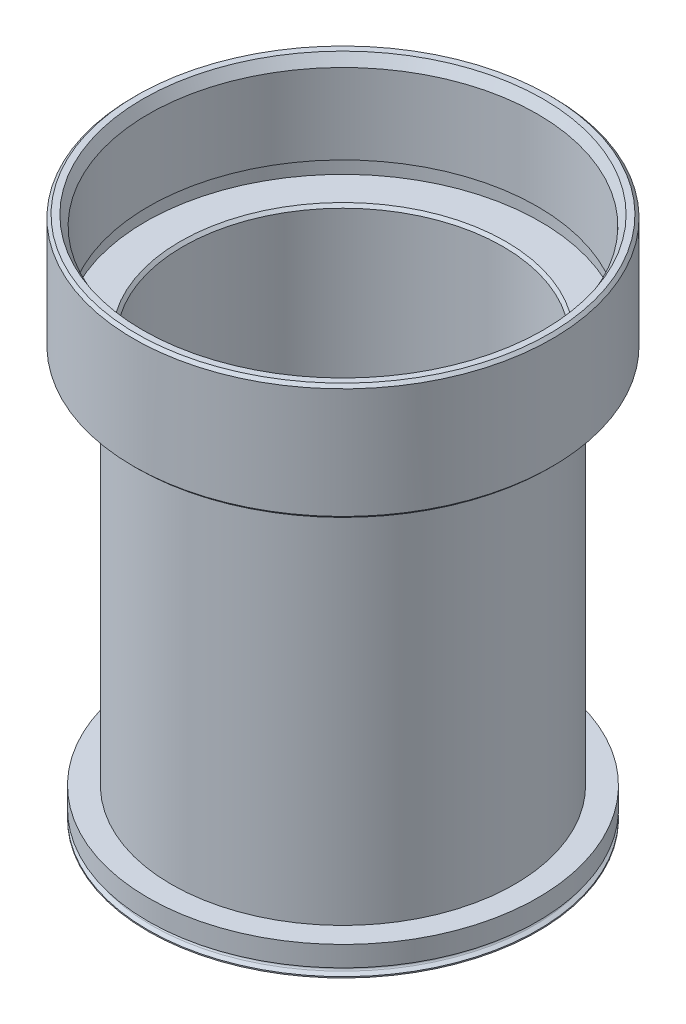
ISO-10303-21;
HEADER;
FILE_DESCRIPTION(('STEP AP214'),'2;1');
FILE_NAME('part.step','',(''),(''),'','','');
FILE_SCHEMA(('AUTOMOTIVE_DESIGN { 1 0 10303 214 1 1 1 1 }'));
ENDSEC;
DATA;
#1=APPLICATION_CONTEXT('core data for automotive mechanical design processes');
#2=APPLICATION_PROTOCOL_DEFINITION('international standard','automotive_design',2000,#1);
#3=PRODUCT_CONTEXT('',#1,'mechanical');
#4=PRODUCT('Part','Part','',(#3));
#5=PRODUCT_RELATED_PRODUCT_CATEGORY('part','',(#4));
#6=PRODUCT_DEFINITION_FORMATION('','',#4);
#7=PRODUCT_DEFINITION_CONTEXT('part definition',#1,'design');
#8=PRODUCT_DEFINITION('design','',#6,#7);
#9=PRODUCT_DEFINITION_SHAPE('','',#8);
#10=(LENGTH_UNIT() NAMED_UNIT(*) SI_UNIT(.MILLI.,.METRE.));
#11=(NAMED_UNIT(*) PLANE_ANGLE_UNIT() SI_UNIT($,.RADIAN.));
#12=(NAMED_UNIT(*) SI_UNIT($,.STERADIAN.) SOLID_ANGLE_UNIT());
#13=UNCERTAINTY_MEASURE_WITH_UNIT(LENGTH_MEASURE(1.E-05),#10,'distance_accuracy_value','');
#14=(GEOMETRIC_REPRESENTATION_CONTEXT(3) GLOBAL_UNCERTAINTY_ASSIGNED_CONTEXT((#13)) GLOBAL_UNIT_ASSIGNED_CONTEXT((#10,
#11,#12)) REPRESENTATION_CONTEXT('',''));
#15=CARTESIAN_POINT('',(0.,0.,0.));
#16=DIRECTION('',(0.,0.,1.));
#17=DIRECTION('',(1.,0.,0.));
#18=AXIS2_PLACEMENT_3D('',#15,#16,#17);
#19=CARTESIAN_POINT('',(0.,69.,0.));
#20=DIRECTION('',(0.,-1.,0.));
#21=DIRECTION('',(0.,0.,-1.));
#22=AXIS2_PLACEMENT_3D('',#19,#20,#21);
#23=TOROIDAL_SURFACE('',#22,30.5,1.);
#24=CARTESIAN_POINT('',(0.,69.,0.));
#25=DIRECTION('',(0.,1.,0.));
#26=DIRECTION('',(0.,0.,1.));
#27=AXIS2_PLACEMENT_3D('',#24,#25,#26);
#28=CIRCLE('',#27,29.5);
#29=CARTESIAN_POINT('',(0.,69.,29.5));
#30=VERTEX_POINT('',#29);
#31=EDGE_CURVE('E43',#30,#30,#28,.F.);
#32=ORIENTED_EDGE('',*,*,#31,.F.);
#33=EDGE_LOOP('',(#32));
#34=FACE_BOUND('',#33,.T.);
#35=CARTESIAN_POINT('',(0.,70.,0.));
#36=DIRECTION('',(0.,-1.,0.));
#37=DIRECTION('',(0.,0.,1.));
#38=AXIS2_PLACEMENT_3D('',#35,#36,#37);
#39=CIRCLE('',#38,30.5);
#40=CARTESIAN_POINT('',(0.,70.,-30.5));
#41=VERTEX_POINT('',#40);
#42=CARTESIAN_POINT('',(0.,70.,30.5));
#43=VERTEX_POINT('',#42);
#44=EDGE_CURVE('E35',#41,#43,#39,.F.);
#45=ORIENTED_EDGE('',*,*,#44,.F.);
#46=CARTESIAN_POINT('',(0.,70.,0.));
#47=DIRECTION('',(0.,-1.,0.));
#48=DIRECTION('',(0.,0.,-1.));
#49=AXIS2_PLACEMENT_3D('',#46,#47,#48);
#50=CIRCLE('',#49,30.5);
#51=EDGE_CURVE('E38',#43,#41,#50,.F.);
#52=ORIENTED_EDGE('',*,*,#51,.F.);
#53=EDGE_LOOP('',(#45,#52));
#54=FACE_BOUND('',#53,.T.);
#55=ADVANCED_FACE('F17',(#34,#54),#23,.F.);
#56=CARTESIAN_POINT('',(33.5,70.,0.));
#57=DIRECTION('',(0.,-1.,0.));
#58=DIRECTION('',(0.,0.,-1.));
#59=AXIS2_PLACEMENT_3D('',#56,#57,#58);
#60=PLANE('',#59);
#61=CARTESIAN_POINT('',(0.,70.,0.));
#62=DIRECTION('',(0.,1.,0.));
#63=DIRECTION('',(0.,0.,1.));
#64=AXIS2_PLACEMENT_3D('',#61,#62,#63);
#65=CIRCLE('',#64,35.5);
#66=CARTESIAN_POINT('',(0.,70.,35.5));
#67=VERTEX_POINT('',#66);
#68=EDGE_CURVE('E47',#67,#67,#65,.T.);
#69=ORIENTED_EDGE('',*,*,#68,.F.);
#70=EDGE_LOOP('',(#69));
#71=FACE_BOUND('',#70,.T.);
#72=ORIENTED_EDGE('',*,*,#44,.T.);
#73=ORIENTED_EDGE('',*,*,#51,.T.);
#74=EDGE_LOOP('',(#72,#73));
#75=FACE_BOUND('',#74,.T.);
#76=ADVANCED_FACE('F40',(#71,#75),#60,.T.);
#77=CARTESIAN_POINT('',(0.,82.6698220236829,0.));
#78=DIRECTION('',(0.,1.,0.));
#79=DIRECTION('',(0.,0.,1.));
#80=AXIS2_PLACEMENT_3D('',#77,#78,#79);
#81=CYLINDRICAL_SURFACE('',#80,29.5);
#82=ORIENTED_EDGE('',*,*,#31,.T.);
#83=EDGE_LOOP('',(#82));
#84=FACE_BOUND('',#83,.T.);
#85=CARTESIAN_POINT('',(0.,5.,0.));
#86=DIRECTION('',(0.,1.,0.));
#87=DIRECTION('',(0.,0.,1.));
#88=AXIS2_PLACEMENT_3D('',#85,#86,#87);
#89=CIRCLE('',#88,29.5);
#90=CARTESIAN_POINT('',(0.,5.,29.5));
#91=VERTEX_POINT('',#90);
#92=EDGE_CURVE('E50',#91,#91,#89,.T.);
#93=ORIENTED_EDGE('',*,*,#92,.T.);
#94=EDGE_LOOP('',(#93));
#95=FACE_BOUND('',#94,.T.);
#96=ADVANCED_FACE('F107',(#84,#95),#81,.T.);
#97=CARTESIAN_POINT('',(0.,70.5,0.));
#98=DIRECTION('',(0.,1.,0.));
#99=DIRECTION('',(0.,0.,1.));
#100=AXIS2_PLACEMENT_3D('',#97,#98,#99);
#101=CONICAL_SURFACE('',#100,36.,0.785398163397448);
#102=CARTESIAN_POINT('',(0.,70.5,0.));
#103=DIRECTION('',(0.,-1.,0.));
#104=DIRECTION('',(0.,0.,-1.));
#105=AXIS2_PLACEMENT_3D('',#102,#103,#104);
#106=CIRCLE('',#105,36.);
#107=CARTESIAN_POINT('',(0.,70.5,-36.));
#108=VERTEX_POINT('',#107);
#109=EDGE_CURVE('E53',#108,#108,#106,.F.);
#110=ORIENTED_EDGE('',*,*,#109,.F.);
#111=EDGE_LOOP('',(#110));
#112=FACE_BOUND('',#111,.T.);
#113=ORIENTED_EDGE('',*,*,#68,.T.);
#114=EDGE_LOOP('',(#113));
#115=FACE_BOUND('',#114,.T.);
#116=ADVANCED_FACE('F166',(#112,#115),#101,.T.);
#117=CARTESIAN_POINT('',(-35.5,5.,0.));
#118=DIRECTION('',(0.,-1.,0.));
#119=DIRECTION('',(0.,0.,-1.));
#120=AXIS2_PLACEMENT_3D('',#117,#118,#119);
#121=PLANE('',#120);
#122=ORIENTED_EDGE('',*,*,#92,.F.);
#123=EDGE_LOOP('',(#122));
#124=FACE_BOUND('',#123,.T.);
#125=CARTESIAN_POINT('',(0.,5.,0.));
#126=DIRECTION('',(0.,-1.,0.));
#127=DIRECTION('',(0.,0.,-1.));
#128=AXIS2_PLACEMENT_3D('',#125,#126,#127);
#129=CIRCLE('',#128,33.5);
#130=CARTESIAN_POINT('',(0.,5.,-33.5));
#131=VERTEX_POINT('',#130);
#132=EDGE_CURVE('E54',#131,#131,#129,.T.);
#133=ORIENTED_EDGE('',*,*,#132,.F.);
#134=EDGE_LOOP('',(#133));
#135=FACE_BOUND('',#134,.T.);
#136=ADVANCED_FACE('F163',(#124,#135),#121,.F.);
#137=CARTESIAN_POINT('',(0.,-7.5,0.));
#138=DIRECTION('',(0.,-1.,0.));
#139=DIRECTION('',(0.,0.,-1.));
#140=AXIS2_PLACEMENT_3D('',#137,#138,#139);
#141=CYLINDRICAL_SURFACE('',#140,36.);
#142=ORIENTED_EDGE('',*,*,#109,.T.);
#143=EDGE_LOOP('',(#142));
#144=FACE_BOUND('',#143,.T.);
#145=CARTESIAN_POINT('',(0.,89.5,0.));
#146=DIRECTION('',(0.,-1.,0.));
#147=DIRECTION('',(0.,0.,-1.));
#148=AXIS2_PLACEMENT_3D('',#145,#146,#147);
#149=CIRCLE('',#148,36.);
#150=CARTESIAN_POINT('',(0.,89.5,-36.));
#151=VERTEX_POINT('',#150);
#152=EDGE_CURVE('E57',#151,#151,#149,.F.);
#153=ORIENTED_EDGE('',*,*,#152,.F.);
#154=EDGE_LOOP('',(#153));
#155=FACE_BOUND('',#154,.T.);
#156=ADVANCED_FACE('F159',(#144,#155),#141,.T.);
#157=CARTESIAN_POINT('',(0.,-7.5,0.));
#158=DIRECTION('',(0.,-1.,0.));
#159=DIRECTION('',(0.,0.,-1.));
#160=AXIS2_PLACEMENT_3D('',#157,#158,#159);
#161=CYLINDRICAL_SURFACE('',#160,33.5);
#162=ORIENTED_EDGE('',*,*,#132,.T.);
#163=EDGE_LOOP('',(#162));
#164=FACE_BOUND('',#163,.T.);
#165=CARTESIAN_POINT('',(0.,1.50000000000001,0.));
#166=DIRECTION('',(0.,1.,0.));
#167=DIRECTION('',(0.,0.,1.));
#168=AXIS2_PLACEMENT_3D('',#165,#166,#167);
#169=CIRCLE('',#168,33.5);
#170=CARTESIAN_POINT('',(0.,1.50000000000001,33.5));
#171=VERTEX_POINT('',#170);
#172=EDGE_CURVE('E62',#171,#171,#169,.F.);
#173=ORIENTED_EDGE('',*,*,#172,.F.);
#174=EDGE_LOOP('',(#173));
#175=FACE_BOUND('',#174,.T.);
#176=ADVANCED_FACE('F155',(#164,#175),#161,.T.);
#177=CARTESIAN_POINT('',(0.,89.5,0.));
#178=DIRECTION('',(0.,-1.,0.));
#179=DIRECTION('',(0.,0.,-1.));
#180=AXIS2_PLACEMENT_3D('',#177,#178,#179);
#181=CONICAL_SURFACE('',#180,36.,0.785398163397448);
#182=ORIENTED_EDGE('',*,*,#152,.T.);
#183=EDGE_LOOP('',(#182));
#184=FACE_BOUND('',#183,.T.);
#185=CARTESIAN_POINT('',(0.,90.,0.));
#186=DIRECTION('',(0.,-1.,0.));
#187=DIRECTION('',(0.,0.,-1.));
#188=AXIS2_PLACEMENT_3D('',#185,#186,#187);
#189=CIRCLE('',#188,35.5);
#190=CARTESIAN_POINT('',(0.,90.,-35.5));
#191=VERTEX_POINT('',#190);
#192=EDGE_CURVE('E58',#191,#191,#189,.F.);
#193=ORIENTED_EDGE('',*,*,#192,.F.);
#194=EDGE_LOOP('',(#193));
#195=FACE_BOUND('',#194,.T.);
#196=ADVANCED_FACE('F151',(#184,#195),#181,.T.);
#197=CARTESIAN_POINT('',(0.,1.50000000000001,0.));
#198=DIRECTION('',(0.,1.,0.));
#199=DIRECTION('',(0.,0.,1.));
#200=AXIS2_PLACEMENT_3D('',#197,#198,#199);
#201=CONICAL_SURFACE('',#200,33.5,1.04719755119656);
#202=CARTESIAN_POINT('',(0.,1.13217967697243,0.));
#203=DIRECTION('',(0.,1.,0.));
#204=DIRECTION('',(0.,0.,1.));
#205=AXIS2_PLACEMENT_3D('',#202,#203,#204);
#206=CIRCLE('',#205,32.8629165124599);
#207=CARTESIAN_POINT('',(0.,1.13217967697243,32.8629165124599));
#208=VERTEX_POINT('',#207);
#209=EDGE_CURVE('E61',#208,#208,#206,.T.);
#210=ORIENTED_EDGE('',*,*,#209,.T.);
#211=EDGE_LOOP('',(#210));
#212=FACE_BOUND('',#211,.T.);
#213=ORIENTED_EDGE('',*,*,#172,.T.);
#214=EDGE_LOOP('',(#213));
#215=FACE_BOUND('',#214,.T.);
#216=ADVANCED_FACE('F147',(#212,#215),#201,.T.);
#217=CARTESIAN_POINT('',(33.425,90.,0.));
#218=DIRECTION('',(0.,1.,0.));
#219=DIRECTION('',(0.,0.,1.));
#220=AXIS2_PLACEMENT_3D('',#217,#218,#219);
#221=PLANE('',#220);
#222=CARTESIAN_POINT('',(0.,90.,0.));
#223=DIRECTION('',(0.,1.,0.));
#224=DIRECTION('',(0.,0.,1.));
#225=AXIS2_PLACEMENT_3D('',#222,#223,#224);
#226=CIRCLE('',#225,34.425);
#227=CARTESIAN_POINT('',(0.,90.,34.425));
#228=VERTEX_POINT('',#227);
#229=EDGE_CURVE('E63',#228,#228,#226,.F.);
#230=ORIENTED_EDGE('',*,*,#229,.T.);
#231=EDGE_LOOP('',(#230));
#232=FACE_BOUND('',#231,.T.);
#233=ORIENTED_EDGE('',*,*,#192,.T.);
#234=EDGE_LOOP('',(#233));
#235=FACE_BOUND('',#234,.T.);
#236=ADVANCED_FACE('F143',(#232,#235),#221,.T.);
#237=CARTESIAN_POINT('',(0.,90.,0.));
#238=DIRECTION('',(0.,1.,0.));
#239=DIRECTION('',(0.,0.,1.));
#240=AXIS2_PLACEMENT_3D('',#237,#238,#239);
#241=CONICAL_SURFACE('',#240,34.425,0.523598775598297);
#242=ORIENTED_EDGE('',*,*,#229,.F.);
#243=EDGE_LOOP('',(#242));
#244=FACE_BOUND('',#243,.T.);
#245=CARTESIAN_POINT('',(0.,88.2679491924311,0.));
#246=DIRECTION('',(0.,-1.,0.));
#247=DIRECTION('',(0.,0.,-1.));
#248=AXIS2_PLACEMENT_3D('',#245,#246,#247);
#249=CIRCLE('',#248,33.425);
#250=CARTESIAN_POINT('',(0.,88.2679491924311,-33.425));
#251=VERTEX_POINT('',#250);
#252=EDGE_CURVE('E66',#251,#251,#249,.T.);
#253=ORIENTED_EDGE('',*,*,#252,.T.);
#254=EDGE_LOOP('',(#253));
#255=FACE_BOUND('',#254,.T.);
#256=ADVANCED_FACE('F138',(#244,#255),#241,.F.);
#257=CARTESIAN_POINT('',(0.,0.849999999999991,0.));
#258=DIRECTION('',(0.,1.,0.));
#259=DIRECTION('',(0.,0.,1.));
#260=AXIS2_PLACEMENT_3D('',#257,#258,#259);
#261=TOROIDAL_SURFACE('',#260,33.0258330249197,0.325833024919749);
#262=ORIENTED_EDGE('',*,*,#209,.F.);
#263=EDGE_LOOP('',(#262));
#264=FACE_BOUND('',#263,.T.);
#265=CARTESIAN_POINT('',(0.,0.567820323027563,0.));
#266=DIRECTION('',(0.,-1.,0.));
#267=DIRECTION('',(0.,0.,-1.));
#268=AXIS2_PLACEMENT_3D('',#265,#266,#267);
#269=CIRCLE('',#268,32.8629165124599);
#270=CARTESIAN_POINT('',(0.,0.567820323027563,-32.8629165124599));
#271=VERTEX_POINT('',#270);
#272=EDGE_CURVE('E71',#271,#271,#269,.T.);
#273=ORIENTED_EDGE('',*,*,#272,.F.);
#274=EDGE_LOOP('',(#273));
#275=FACE_BOUND('',#274,.T.);
#276=ADVANCED_FACE('F133',(#264,#275),#261,.F.);
#277=CARTESIAN_POINT('',(0.,-7.5,0.));
#278=DIRECTION('',(0.,-1.,0.));
#279=DIRECTION('',(0.,0.,-1.));
#280=AXIS2_PLACEMENT_3D('',#277,#278,#279);
#281=CYLINDRICAL_SURFACE('',#280,33.425);
#282=CARTESIAN_POINT('',(0.,74.5,0.));
#283=DIRECTION('',(0.,-1.,0.));
#284=DIRECTION('',(0.,0.,-1.));
#285=AXIS2_PLACEMENT_3D('',#282,#283,#284);
#286=CIRCLE('',#285,33.425);
#287=CARTESIAN_POINT('',(0.,74.5,-33.425));
#288=VERTEX_POINT('',#287);
#289=EDGE_CURVE('E67',#288,#288,#286,.T.);
#290=ORIENTED_EDGE('',*,*,#289,.T.);
#291=EDGE_LOOP('',(#290));
#292=FACE_BOUND('',#291,.T.);
#293=ORIENTED_EDGE('',*,*,#252,.F.);
#294=EDGE_LOOP('',(#293));
#295=FACE_BOUND('',#294,.T.);
#296=ADVANCED_FACE('F137',(#292,#295),#281,.F.);
#297=CARTESIAN_POINT('',(0.,0.200000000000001,0.));
#298=DIRECTION('',(0.,-1.,0.));
#299=DIRECTION('',(0.,0.,-1.));
#300=AXIS2_PLACEMENT_3D('',#297,#298,#299);
#301=CONICAL_SURFACE('',#300,33.5,1.0471975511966);
#302=ORIENTED_EDGE('',*,*,#272,.T.);
#303=EDGE_LOOP('',(#302));
#304=FACE_BOUND('',#303,.T.);
#305=CARTESIAN_POINT('',(0.,0.200000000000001,0.));
#306=DIRECTION('',(0.,-1.,0.));
#307=DIRECTION('',(0.,0.,-1.));
#308=AXIS2_PLACEMENT_3D('',#305,#306,#307);
#309=CIRCLE('',#308,33.5);
#310=CARTESIAN_POINT('',(0.,0.200000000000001,-33.5));
#311=VERTEX_POINT('',#310);
#312=EDGE_CURVE('E70',#311,#311,#309,.T.);
#313=ORIENTED_EDGE('',*,*,#312,.F.);
#314=EDGE_LOOP('',(#313));
#315=FACE_BOUND('',#314,.T.);
#316=ADVANCED_FACE('F212',(#304,#315),#301,.T.);
#317=CARTESIAN_POINT('',(0.,74.5,33.425));
#318=DIRECTION('',(0.,1.,0.));
#319=DIRECTION('',(0.,0.,1.));
#320=AXIS2_PLACEMENT_3D('',#317,#318,#319);
#321=PLANE('',#320);
#322=ORIENTED_EDGE('',*,*,#289,.F.);
#323=EDGE_LOOP('',(#322));
#324=FACE_BOUND('',#323,.T.);
#325=CARTESIAN_POINT('',(0.,74.5,0.));
#326=DIRECTION('',(0.,1.,0.));
#327=DIRECTION('',(0.,0.,1.));
#328=AXIS2_PLACEMENT_3D('',#325,#326,#327);
#329=CIRCLE('',#328,33.925);
#330=CARTESIAN_POINT('',(0.,74.5,33.925));
#331=VERTEX_POINT('',#330);
#332=EDGE_CURVE('E72',#331,#331,#329,.F.);
#333=ORIENTED_EDGE('',*,*,#332,.T.);
#334=EDGE_LOOP('',(#333));
#335=FACE_BOUND('',#334,.T.);
#336=ADVANCED_FACE('F209',(#324,#335),#321,.F.);
#337=CARTESIAN_POINT('',(0.,-7.5,0.));
#338=DIRECTION('',(0.,-1.,0.));
#339=DIRECTION('',(0.,0.,-1.));
#340=AXIS2_PLACEMENT_3D('',#337,#338,#339);
#341=CYLINDRICAL_SURFACE('',#340,33.5);
#342=ORIENTED_EDGE('',*,*,#312,.T.);
#343=EDGE_LOOP('',(#342));
#344=FACE_BOUND('',#343,.T.);
#345=CARTESIAN_POINT('',(0.,0.,0.));
#346=DIRECTION('',(0.,-1.,0.));
#347=DIRECTION('',(0.,0.,-1.));
#348=AXIS2_PLACEMENT_3D('',#345,#346,#347);
#349=CIRCLE('',#348,33.5);
#350=CARTESIAN_POINT('',(0.,0.,-33.5));
#351=VERTEX_POINT('',#350);
#352=EDGE_CURVE('E75',#351,#351,#349,.T.);
#353=ORIENTED_EDGE('',*,*,#352,.F.);
#354=EDGE_LOOP('',(#353));
#355=FACE_BOUND('',#354,.T.);
#356=ADVANCED_FACE('F205',(#344,#355),#341,.T.);
#357=CARTESIAN_POINT('',(0.,121.620347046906,0.));
#358=DIRECTION('',(0.,1.,0.));
#359=DIRECTION('',(0.,0.,1.));
#360=AXIS2_PLACEMENT_3D('',#357,#358,#359);
#361=CYLINDRICAL_SURFACE('',#360,33.925);
#362=ORIENTED_EDGE('',*,*,#332,.F.);
#363=EDGE_LOOP('',(#362));
#364=FACE_BOUND('',#363,.T.);
#365=CARTESIAN_POINT('',(0.,72.,0.));
#366=DIRECTION('',(0.,1.,0.));
#367=DIRECTION('',(0.,0.,1.));
#368=AXIS2_PLACEMENT_3D('',#365,#366,#367);
#369=CIRCLE('',#368,33.925);
#370=CARTESIAN_POINT('',(0.,72.,33.925));
#371=VERTEX_POINT('',#370);
#372=EDGE_CURVE('E78',#371,#371,#369,.T.);
#373=ORIENTED_EDGE('',*,*,#372,.F.);
#374=EDGE_LOOP('',(#373));
#375=FACE_BOUND('',#374,.T.);
#376=ADVANCED_FACE('F201',(#364,#375),#361,.F.);
#377=CARTESIAN_POINT('',(27.5,0.,0.));
#378=DIRECTION('',(0.,-1.,0.));
#379=DIRECTION('',(0.,0.,-1.));
#380=AXIS2_PLACEMENT_3D('',#377,#378,#379);
#381=PLANE('',#380);
#382=CARTESIAN_POINT('',(0.,0.,0.));
#383=DIRECTION('',(0.,-1.,0.));
#384=DIRECTION('',(1.,0.,0.));
#385=AXIS2_PLACEMENT_3D('',#382,#383,#384);
#386=CIRCLE('',#385,32.3);
#387=CARTESIAN_POINT('',(32.3,0.,0.));
#388=VERTEX_POINT('',#387);
#389=EDGE_CURVE('E81',#388,#388,#386,.F.);
#390=ORIENTED_EDGE('',*,*,#389,.T.);
#391=EDGE_LOOP('',(#390));
#392=FACE_BOUND('',#391,.T.);
#393=ORIENTED_EDGE('',*,*,#352,.T.);
#394=EDGE_LOOP('',(#393));
#395=FACE_BOUND('',#394,.T.);
#396=ADVANCED_FACE('F197',(#392,#395),#381,.T.);
#397=CARTESIAN_POINT('',(27.5,72.,0.));
#398=DIRECTION('',(0.,1.,0.));
#399=DIRECTION('',(0.,0.,1.));
#400=AXIS2_PLACEMENT_3D('',#397,#398,#399);
#401=PLANE('',#400);
#402=ORIENTED_EDGE('',*,*,#372,.T.);
#403=EDGE_LOOP('',(#402));
#404=FACE_BOUND('',#403,.T.);
#405=CARTESIAN_POINT('',(0.,72.,0.));
#406=DIRECTION('',(0.,1.,0.));
#407=DIRECTION('',(0.,0.,1.));
#408=AXIS2_PLACEMENT_3D('',#405,#406,#407);
#409=CIRCLE('',#408,28.);
#410=CARTESIAN_POINT('',(0.,72.,28.));
#411=VERTEX_POINT('',#410);
#412=EDGE_CURVE('E84',#411,#411,#409,.F.);
#413=ORIENTED_EDGE('',*,*,#412,.T.);
#414=EDGE_LOOP('',(#413));
#415=FACE_BOUND('',#414,.T.);
#416=ADVANCED_FACE('F193',(#404,#415),#401,.T.);
#417=CARTESIAN_POINT('',(0.,0.,0.));
#418=DIRECTION('',(0.,-1.,0.));
#419=DIRECTION('',(1.,0.,0.));
#420=AXIS2_PLACEMENT_3D('',#417,#418,#419);
#421=CONICAL_SURFACE('',#420,32.3,1.04719755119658);
#422=ORIENTED_EDGE('',*,*,#389,.F.);
#423=EDGE_LOOP('',(#422));
#424=FACE_BOUND('',#423,.T.);
#425=CARTESIAN_POINT('',(0.,2.77128129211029,0.));
#426=DIRECTION('',(0.,-1.,0.));
#427=DIRECTION('',(0.,0.,-1.));
#428=AXIS2_PLACEMENT_3D('',#425,#426,#427);
#429=CIRCLE('',#428,27.5);
#430=CARTESIAN_POINT('',(0.,2.77128129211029,-27.5));
#431=VERTEX_POINT('',#430);
#432=EDGE_CURVE('E29',#431,#431,#429,.F.);
#433=ORIENTED_EDGE('',*,*,#432,.T.);
#434=EDGE_LOOP('',(#433));
#435=FACE_BOUND('',#434,.T.);
#436=ADVANCED_FACE('F185',(#424,#435),#421,.F.);
#437=CARTESIAN_POINT('',(0.,72.,0.));
#438=DIRECTION('',(0.,1.,0.));
#439=DIRECTION('',(0.,0.,1.));
#440=AXIS2_PLACEMENT_3D('',#437,#438,#439);
#441=CONICAL_SURFACE('',#440,28.,0.785398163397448);
#442=CARTESIAN_POINT('',(0.,71.5,0.));
#443=DIRECTION('',(0.,-1.,0.));
#444=DIRECTION('',(0.,0.,-1.));
#445=AXIS2_PLACEMENT_3D('',#442,#443,#444);
#446=CIRCLE('',#445,27.5);
#447=CARTESIAN_POINT('',(0.,71.5,-27.5));
#448=VERTEX_POINT('',#447);
#449=EDGE_CURVE('E11',#448,#448,#446,.T.);
#450=ORIENTED_EDGE('',*,*,#449,.T.);
#451=EDGE_LOOP('',(#450));
#452=FACE_BOUND('',#451,.T.);
#453=ORIENTED_EDGE('',*,*,#412,.F.);
#454=EDGE_LOOP('',(#453));
#455=FACE_BOUND('',#454,.T.);
#456=ADVANCED_FACE('F179',(#452,#455),#441,.F.);
#457=CARTESIAN_POINT('',(0.,-7.5,0.));
#458=DIRECTION('',(0.,-1.,0.));
#459=DIRECTION('',(0.,0.,-1.));
#460=AXIS2_PLACEMENT_3D('',#457,#458,#459);
#461=CYLINDRICAL_SURFACE('',#460,27.5);
#462=ORIENTED_EDGE('',*,*,#432,.F.);
#463=EDGE_LOOP('',(#462));
#464=FACE_BOUND('',#463,.T.);
#465=ORIENTED_EDGE('',*,*,#449,.F.);
#466=EDGE_LOOP('',(#465));
#467=FACE_BOUND('',#466,.T.);
#468=ADVANCED_FACE('F177',(#464,#467),#461,.F.);
#469=CLOSED_SHELL('',(#55,#76,#96,#116,#136,#156,#176,#196,#216,#236,#256,#276,#296,#316,#336,
#356,#376,#396,#416,#436,#456,#468));
#470=MANIFOLD_SOLID_BREP('B1',#469);
#471=ADVANCED_BREP_SHAPE_REPRESENTATION('',(#18,#470),#14);
#472=SHAPE_DEFINITION_REPRESENTATION(#9,#471);
ENDSEC;
END-ISO-10303-21;
